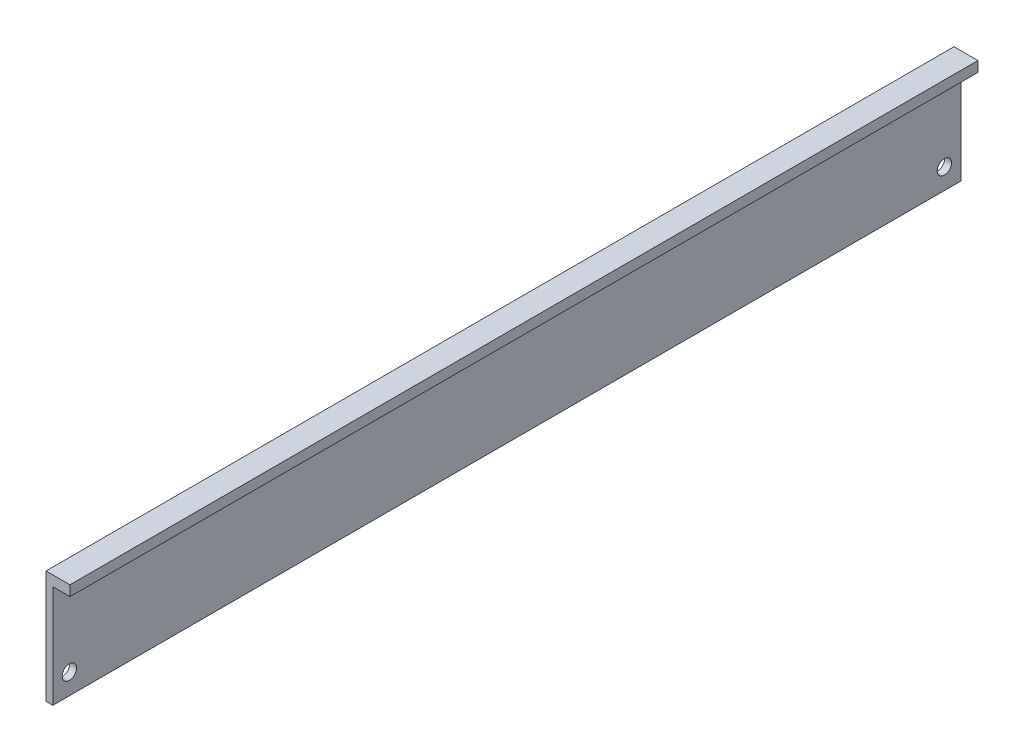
ISO-10303-21;
HEADER;
FILE_DESCRIPTION(('STEP AP214'),'2;1');
FILE_NAME('part.step','',(''),(''),'','','');
FILE_SCHEMA(('AUTOMOTIVE_DESIGN { 1 0 10303 214 1 1 1 1 }'));
ENDSEC;
DATA;
#1=APPLICATION_CONTEXT('core data for automotive mechanical design processes');
#2=APPLICATION_PROTOCOL_DEFINITION('international standard','automotive_design',2000,#1);
#3=PRODUCT_CONTEXT('',#1,'mechanical');
#4=PRODUCT('Part','Part','',(#3));
#5=PRODUCT_RELATED_PRODUCT_CATEGORY('part','',(#4));
#6=PRODUCT_DEFINITION_FORMATION('','',#4);
#7=PRODUCT_DEFINITION_CONTEXT('part definition',#1,'design');
#8=PRODUCT_DEFINITION('design','',#6,#7);
#9=PRODUCT_DEFINITION_SHAPE('','',#8);
#10=(LENGTH_UNIT() NAMED_UNIT(*) SI_UNIT(.MILLI.,.METRE.));
#11=(NAMED_UNIT(*) PLANE_ANGLE_UNIT() SI_UNIT($,.RADIAN.));
#12=(NAMED_UNIT(*) SI_UNIT($,.STERADIAN.) SOLID_ANGLE_UNIT());
#13=UNCERTAINTY_MEASURE_WITH_UNIT(LENGTH_MEASURE(1.E-05),#10,'distance_accuracy_value','');
#14=(GEOMETRIC_REPRESENTATION_CONTEXT(3) GLOBAL_UNCERTAINTY_ASSIGNED_CONTEXT((#13)) GLOBAL_UNIT_ASSIGNED_CONTEXT((#10,
#11,#12)) REPRESENTATION_CONTEXT('',''));
#15=CARTESIAN_POINT('',(0.,0.,0.));
#16=DIRECTION('',(0.,0.,1.));
#17=DIRECTION('',(1.,0.,0.));
#18=AXIS2_PLACEMENT_3D('',#15,#16,#17);
#19=CARTESIAN_POINT('',(4146.36645330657,1662.26594666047,0.));
#20=DIRECTION('',(0.,-1.,0.));
#21=DIRECTION('',(0.,0.,-1.));
#22=AXIS2_PLACEMENT_3D('',#19,#20,#21);
#23=PLANE('',#22);
#24=DIRECTION('',(0.,0.,-1.));
#25=VECTOR('',#24,1.);
#26=CARTESIAN_POINT('',(4148.36645330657,1662.26594666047,0.));
#27=LINE('',#26,#25);
#28=CARTESIAN_POINT('',(4148.36645330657,1662.26594666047,133.35));
#29=VERTEX_POINT('',#28);
#30=CARTESIAN_POINT('',(4148.36645330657,1662.26594666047,-132.));
#31=VERTEX_POINT('',#30);
#32=EDGE_CURVE('E78',#29,#31,#27,.T.);
#33=ORIENTED_EDGE('',*,*,#32,.F.);
#34=DIRECTION('',(1.,0.,0.));
#35=VECTOR('',#34,1.);
#36=CARTESIAN_POINT('',(4146.36645330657,1662.26594666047,133.35));
#37=LINE('',#36,#35);
#38=CARTESIAN_POINT('',(4146.36645330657,1662.26594666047,133.35));
#39=VERTEX_POINT('',#38);
#40=EDGE_CURVE('E100',#39,#29,#37,.T.);
#41=ORIENTED_EDGE('',*,*,#40,.F.);
#42=DIRECTION('',(0.,0.,-1.));
#43=VECTOR('',#42,1.);
#44=CARTESIAN_POINT('',(4146.36645330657,1662.26594666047,0.));
#45=LINE('',#44,#43);
#46=CARTESIAN_POINT('',(4146.36645330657,1662.26594666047,-132.));
#47=VERTEX_POINT('',#46);
#48=EDGE_CURVE('E138',#39,#47,#45,.T.);
#49=ORIENTED_EDGE('',*,*,#48,.T.);
#50=DIRECTION('',(1.,0.,0.));
#51=VECTOR('',#50,1.);
#52=CARTESIAN_POINT('',(4146.36645330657,1662.26594666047,-132.));
#53=LINE('',#52,#51);
#54=EDGE_CURVE('E45',#47,#31,#53,.T.);
#55=ORIENTED_EDGE('',*,*,#54,.T.);
#56=EDGE_LOOP('',(#33,#41,#49,#55));
#57=FACE_BOUND('',#56,.T.);
#58=ADVANCED_FACE('F37',(#57),#23,.T.);
#59=CARTESIAN_POINT('',(4146.36645330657,1695.26594666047,-132.));
#60=DIRECTION('',(0.,1.,0.));
#61=DIRECTION('',(0.,0.,1.));
#62=AXIS2_PLACEMENT_3D('',#59,#60,#61);
#63=PLANE('',#62);
#64=DIRECTION('',(0.,0.,1.));
#65=VECTOR('',#64,1.);
#66=CARTESIAN_POINT('',(4153.36645330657,1695.26594666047,-132.));
#67=LINE('',#66,#65);
#68=CARTESIAN_POINT('',(4153.36645330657,1695.26594666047,-132.));
#69=VERTEX_POINT('',#68);
#70=CARTESIAN_POINT('',(4153.36645330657,1695.26594666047,133.35));
#71=VERTEX_POINT('',#70);
#72=EDGE_CURVE('E141',#69,#71,#67,.T.);
#73=ORIENTED_EDGE('',*,*,#72,.F.);
#74=DIRECTION('',(1.,0.,0.));
#75=VECTOR('',#74,1.);
#76=CARTESIAN_POINT('',(4146.36645330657,1695.26594666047,-132.));
#77=LINE('',#76,#75);
#78=CARTESIAN_POINT('',(4146.36645330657,1695.26594666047,-132.));
#79=VERTEX_POINT('',#78);
#80=EDGE_CURVE('E11',#79,#69,#77,.T.);
#81=ORIENTED_EDGE('',*,*,#80,.F.);
#82=DIRECTION('',(0.,0.,1.));
#83=VECTOR('',#82,1.);
#84=CARTESIAN_POINT('',(4146.36645330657,1695.26594666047,-132.));
#85=LINE('',#84,#83);
#86=CARTESIAN_POINT('',(4146.36645330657,1695.26594666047,133.35));
#87=VERTEX_POINT('',#86);
#88=EDGE_CURVE('E144',#79,#87,#85,.T.);
#89=ORIENTED_EDGE('',*,*,#88,.T.);
#90=DIRECTION('',(-1.,0.,0.));
#91=VECTOR('',#90,1.);
#92=CARTESIAN_POINT('',(4153.36645330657,1695.26594666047,133.35));
#93=LINE('',#92,#91);
#94=EDGE_CURVE('E126',#71,#87,#93,.T.);
#95=ORIENTED_EDGE('',*,*,#94,.F.);
#96=EDGE_LOOP('',(#73,#81,#89,#95));
#97=FACE_BOUND('',#96,.T.);
#98=ADVANCED_FACE('F165',(#97),#63,.T.);
#99=CARTESIAN_POINT('',(4146.36645330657,1662.26594666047,-132.));
#100=DIRECTION('',(0.,0.,-1.));
#101=DIRECTION('',(-1.,0.,0.));
#102=AXIS2_PLACEMENT_3D('',#99,#100,#101);
#103=PLANE('',#102);
#104=DIRECTION('',(0.,1.,0.));
#105=VECTOR('',#104,1.);
#106=CARTESIAN_POINT('',(4148.36645330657,1662.26594666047,-132.));
#107=LINE('',#106,#105);
#108=CARTESIAN_POINT('',(4148.36645330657,1692.26594666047,-132.));
#109=VERTEX_POINT('',#108);
#110=EDGE_CURVE('E133',#31,#109,#107,.T.);
#111=ORIENTED_EDGE('',*,*,#110,.F.);
#112=ORIENTED_EDGE('',*,*,#54,.F.);
#113=DIRECTION('',(0.,1.,0.));
#114=VECTOR('',#113,1.);
#115=CARTESIAN_POINT('',(4146.36645330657,1662.26594666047,-132.));
#116=LINE('',#115,#114);
#117=EDGE_CURVE('E140',#47,#79,#116,.T.);
#118=ORIENTED_EDGE('',*,*,#117,.T.);
#119=ORIENTED_EDGE('',*,*,#80,.T.);
#120=DIRECTION('',(0.,1.,0.));
#121=VECTOR('',#120,1.);
#122=CARTESIAN_POINT('',(4153.36645330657,1662.26594666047,-132.));
#123=LINE('',#122,#121);
#124=CARTESIAN_POINT('',(4153.36645330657,1692.26594666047,-132.));
#125=VERTEX_POINT('',#124);
#126=EDGE_CURVE('E71',#125,#69,#123,.T.);
#127=ORIENTED_EDGE('',*,*,#126,.F.);
#128=DIRECTION('',(1.,0.,0.));
#129=VECTOR('',#128,1.);
#130=CARTESIAN_POINT('',(4148.36645330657,1692.26594666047,-132.));
#131=LINE('',#130,#129);
#132=EDGE_CURVE('E53',#109,#125,#131,.T.);
#133=ORIENTED_EDGE('',*,*,#132,.F.);
#134=EDGE_LOOP('',(#111,#112,#118,#119,#127,#133));
#135=FACE_BOUND('',#134,.T.);
#136=ADVANCED_FACE('F169',(#135),#103,.T.);
#137=CARTESIAN_POINT('',(4146.36645330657,0.,0.));
#138=DIRECTION('',(1.,0.,0.));
#139=DIRECTION('',(0.,0.,-1.));
#140=AXIS2_PLACEMENT_3D('',#137,#138,#139);
#141=PLANE('',#140);
#142=CARTESIAN_POINT('',(4146.36645330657,1668.26594666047,128.52));
#143=DIRECTION('',(-1.,0.,0.));
#144=DIRECTION('',(0.,0.,1.));
#145=AXIS2_PLACEMENT_3D('',#142,#143,#144);
#146=CIRCLE('',#145,2.09999999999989);
#147=CARTESIAN_POINT('',(4146.36645330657,1668.26594666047,130.62));
#148=VERTEX_POINT('',#147);
#149=EDGE_CURVE('E119',#148,#148,#146,.T.);
#150=ORIENTED_EDGE('',*,*,#149,.F.);
#151=EDGE_LOOP('',(#150));
#152=FACE_BOUND('',#151,.T.);
#153=CARTESIAN_POINT('',(4146.36645330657,1668.26594666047,-127.175));
#154=DIRECTION('',(-1.,0.,0.));
#155=DIRECTION('',(0.,0.,1.));
#156=AXIS2_PLACEMENT_3D('',#153,#154,#155);
#157=CIRCLE('',#156,2.09999999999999);
#158=CARTESIAN_POINT('',(4146.36645330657,1668.26594666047,-125.075));
#159=VERTEX_POINT('',#158);
#160=EDGE_CURVE('E129',#159,#159,#157,.T.);
#161=ORIENTED_EDGE('',*,*,#160,.F.);
#162=EDGE_LOOP('',(#161));
#163=FACE_BOUND('',#162,.T.);
#164=ORIENTED_EDGE('',*,*,#48,.F.);
#165=DIRECTION('',(0.,-1.,0.));
#166=VECTOR('',#165,1.);
#167=CARTESIAN_POINT('',(4146.36645330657,1695.26594666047,133.35));
#168=LINE('',#167,#166);
#169=EDGE_CURVE('E116',#87,#39,#168,.T.);
#170=ORIENTED_EDGE('',*,*,#169,.F.);
#171=ORIENTED_EDGE('',*,*,#88,.F.);
#172=ORIENTED_EDGE('',*,*,#117,.F.);
#173=EDGE_LOOP('',(#164,#170,#171,#172));
#174=FACE_BOUND('',#173,.T.);
#175=ADVANCED_FACE('F174',(#152,#163,#174),#141,.F.);
#176=CARTESIAN_POINT('',(4153.36645330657,0.,0.));
#177=DIRECTION('',(1.,0.,0.));
#178=DIRECTION('',(0.,0.,-1.));
#179=AXIS2_PLACEMENT_3D('',#176,#177,#178);
#180=PLANE('',#179);
#181=DIRECTION('',(0.,0.,-1.));
#182=VECTOR('',#181,1.);
#183=CARTESIAN_POINT('',(4153.36645330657,1692.26594666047,0.));
#184=LINE('',#183,#182);
#185=CARTESIAN_POINT('',(4153.36645330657,1692.26594666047,133.35));
#186=VERTEX_POINT('',#185);
#187=EDGE_CURVE('E101',#186,#125,#184,.T.);
#188=ORIENTED_EDGE('',*,*,#187,.T.);
#189=ORIENTED_EDGE('',*,*,#126,.T.);
#190=ORIENTED_EDGE('',*,*,#72,.T.);
#191=DIRECTION('',(0.,1.,0.));
#192=VECTOR('',#191,1.);
#193=CARTESIAN_POINT('',(4153.36645330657,1692.26594666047,133.35));
#194=LINE('',#193,#192);
#195=EDGE_CURVE('E123',#186,#71,#194,.T.);
#196=ORIENTED_EDGE('',*,*,#195,.F.);
#197=EDGE_LOOP('',(#188,#189,#190,#196));
#198=FACE_BOUND('',#197,.T.);
#199=ADVANCED_FACE('F177',(#198),#180,.T.);
#200=CARTESIAN_POINT('',(4148.36645330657,1662.26594666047,0.));
#201=DIRECTION('',(-1.,0.,0.));
#202=DIRECTION('',(0.,0.,1.));
#203=AXIS2_PLACEMENT_3D('',#200,#201,#202);
#204=PLANE('',#203);
#205=CARTESIAN_POINT('',(4148.36645330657,1668.26594666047,128.52));
#206=DIRECTION('',(-1.,0.,0.));
#207=DIRECTION('',(0.,0.,1.));
#208=AXIS2_PLACEMENT_3D('',#205,#206,#207);
#209=CIRCLE('',#208,2.09999999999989);
#210=CARTESIAN_POINT('',(4148.36645330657,1668.26594666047,130.62));
#211=VERTEX_POINT('',#210);
#212=EDGE_CURVE('E40',#211,#211,#209,.T.);
#213=ORIENTED_EDGE('',*,*,#212,.T.);
#214=EDGE_LOOP('',(#213));
#215=FACE_BOUND('',#214,.T.);
#216=CARTESIAN_POINT('',(4148.36645330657,1668.26594666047,-127.175));
#217=DIRECTION('',(-1.,0.,0.));
#218=DIRECTION('',(0.,0.,1.));
#219=AXIS2_PLACEMENT_3D('',#216,#217,#218);
#220=CIRCLE('',#219,2.09999999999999);
#221=CARTESIAN_POINT('',(4148.36645330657,1668.26594666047,-125.075));
#222=VERTEX_POINT('',#221);
#223=EDGE_CURVE('E132',#222,#222,#220,.T.);
#224=ORIENTED_EDGE('',*,*,#223,.T.);
#225=EDGE_LOOP('',(#224));
#226=FACE_BOUND('',#225,.T.);
#227=ORIENTED_EDGE('',*,*,#110,.T.);
#228=DIRECTION('',(0.,0.,-1.));
#229=VECTOR('',#228,1.);
#230=CARTESIAN_POINT('',(4148.36645330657,1692.26594666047,0.));
#231=LINE('',#230,#229);
#232=CARTESIAN_POINT('',(4148.36645330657,1692.26594666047,133.35));
#233=VERTEX_POINT('',#232);
#234=EDGE_CURVE('E106',#233,#109,#231,.T.);
#235=ORIENTED_EDGE('',*,*,#234,.F.);
#236=DIRECTION('',(0.,1.,0.));
#237=VECTOR('',#236,1.);
#238=CARTESIAN_POINT('',(4148.36645330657,1662.26594666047,133.35));
#239=LINE('',#238,#237);
#240=EDGE_CURVE('E104',#29,#233,#239,.T.);
#241=ORIENTED_EDGE('',*,*,#240,.F.);
#242=ORIENTED_EDGE('',*,*,#32,.T.);
#243=EDGE_LOOP('',(#227,#235,#241,#242));
#244=FACE_BOUND('',#243,.T.);
#245=ADVANCED_FACE('F105',(#215,#226,#244),#204,.F.);
#246=CARTESIAN_POINT('',(4148.36645330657,1692.26594666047,0.));
#247=DIRECTION('',(0.,1.,0.));
#248=DIRECTION('',(0.,0.,1.));
#249=AXIS2_PLACEMENT_3D('',#246,#247,#248);
#250=PLANE('',#249);
#251=ORIENTED_EDGE('',*,*,#132,.T.);
#252=ORIENTED_EDGE('',*,*,#187,.F.);
#253=DIRECTION('',(1.,0.,0.));
#254=VECTOR('',#253,1.);
#255=CARTESIAN_POINT('',(4148.36645330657,1692.26594666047,133.35));
#256=LINE('',#255,#254);
#257=EDGE_CURVE('E110',#233,#186,#256,.T.);
#258=ORIENTED_EDGE('',*,*,#257,.F.);
#259=ORIENTED_EDGE('',*,*,#234,.T.);
#260=EDGE_LOOP('',(#251,#252,#258,#259));
#261=FACE_BOUND('',#260,.T.);
#262=ADVANCED_FACE('F154',(#261),#250,.F.);
#263=CARTESIAN_POINT('',(4146.36645330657,1668.26594666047,-127.175));
#264=DIRECTION('',(-1.,0.,0.));
#265=DIRECTION('',(0.,0.,1.));
#266=AXIS2_PLACEMENT_3D('',#263,#264,#265);
#267=CYLINDRICAL_SURFACE('',#266,2.09999999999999);
#268=ORIENTED_EDGE('',*,*,#160,.T.);
#269=EDGE_LOOP('',(#268));
#270=FACE_BOUND('',#269,.T.);
#271=ORIENTED_EDGE('',*,*,#223,.F.);
#272=EDGE_LOOP('',(#271));
#273=FACE_BOUND('',#272,.T.);
#274=ADVANCED_FACE('F152',(#270,#273),#267,.F.);
#275=CARTESIAN_POINT('',(0.,0.,133.35));
#276=DIRECTION('',(0.,0.,1.));
#277=DIRECTION('',(1.,0.,0.));
#278=AXIS2_PLACEMENT_3D('',#275,#276,#277);
#279=PLANE('',#278);
#280=ORIENTED_EDGE('',*,*,#40,.T.);
#281=ORIENTED_EDGE('',*,*,#240,.T.);
#282=ORIENTED_EDGE('',*,*,#257,.T.);
#283=ORIENTED_EDGE('',*,*,#195,.T.);
#284=ORIENTED_EDGE('',*,*,#94,.T.);
#285=ORIENTED_EDGE('',*,*,#169,.T.);
#286=EDGE_LOOP('',(#280,#281,#282,#283,#284,#285));
#287=FACE_BOUND('',#286,.T.);
#288=ADVANCED_FACE('F113',(#287),#279,.T.);
#289=CARTESIAN_POINT('',(4153.36645330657,1668.26594666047,128.52));
#290=DIRECTION('',(-1.,0.,0.));
#291=DIRECTION('',(0.,0.,1.));
#292=AXIS2_PLACEMENT_3D('',#289,#290,#291);
#293=CYLINDRICAL_SURFACE('',#292,2.09999999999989);
#294=ORIENTED_EDGE('',*,*,#149,.T.);
#295=EDGE_LOOP('',(#294));
#296=FACE_BOUND('',#295,.T.);
#297=ORIENTED_EDGE('',*,*,#212,.F.);
#298=EDGE_LOOP('',(#297));
#299=FACE_BOUND('',#298,.T.);
#300=ADVANCED_FACE('F161',(#296,#299),#293,.F.);
#301=CLOSED_SHELL('',(#58,#98,#136,#175,#199,#245,#262,#274,#288,#300));
#302=MANIFOLD_SOLID_BREP('B2',#301);
#303=ADVANCED_BREP_SHAPE_REPRESENTATION('',(#18,#302),#14);
#304=SHAPE_DEFINITION_REPRESENTATION(#9,#303);
ENDSEC;
END-ISO-10303-21;
